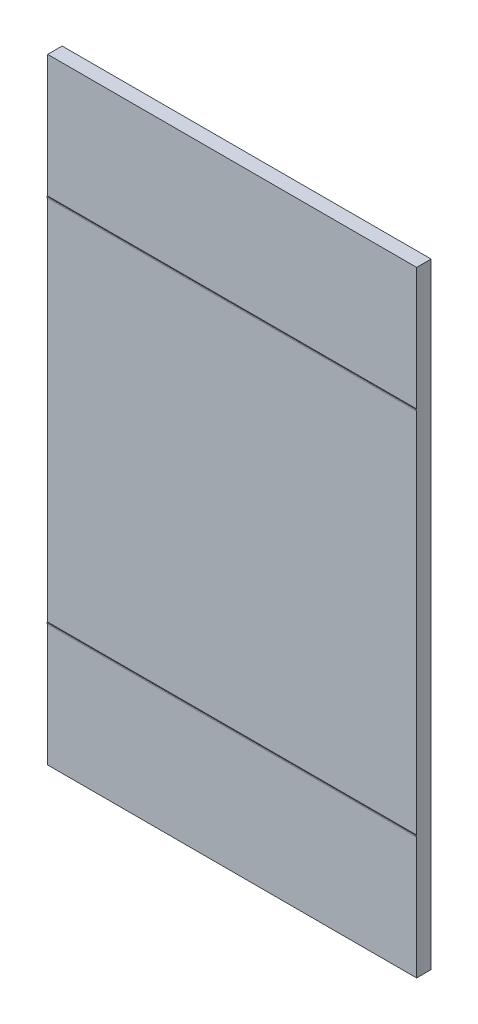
ISO-10303-21;
HEADER;
FILE_DESCRIPTION(('STEP AP214'),'2;1');
FILE_NAME('part.step','',(''),(''),'','','');
FILE_SCHEMA(('AUTOMOTIVE_DESIGN { 1 0 10303 214 1 1 1 1 }'));
ENDSEC;
DATA;
#1=APPLICATION_CONTEXT('core data for automotive mechanical design processes');
#2=APPLICATION_PROTOCOL_DEFINITION('international standard','automotive_design',2000,#1);
#3=PRODUCT_CONTEXT('',#1,'mechanical');
#4=PRODUCT('Part','Part','',(#3));
#5=PRODUCT_RELATED_PRODUCT_CATEGORY('part','',(#4));
#6=PRODUCT_DEFINITION_FORMATION('','',#4);
#7=PRODUCT_DEFINITION_CONTEXT('part definition',#1,'design');
#8=PRODUCT_DEFINITION('design','',#6,#7);
#9=PRODUCT_DEFINITION_SHAPE('','',#8);
#10=(LENGTH_UNIT() NAMED_UNIT(*) SI_UNIT(.MILLI.,.METRE.));
#11=(NAMED_UNIT(*) PLANE_ANGLE_UNIT() SI_UNIT($,.RADIAN.));
#12=(NAMED_UNIT(*) SI_UNIT($,.STERADIAN.) SOLID_ANGLE_UNIT());
#13=UNCERTAINTY_MEASURE_WITH_UNIT(LENGTH_MEASURE(1.E-05),#10,'distance_accuracy_value','');
#14=(GEOMETRIC_REPRESENTATION_CONTEXT(3) GLOBAL_UNCERTAINTY_ASSIGNED_CONTEXT((#13)) GLOBAL_UNIT_ASSIGNED_CONTEXT((#10,
#11,#12)) REPRESENTATION_CONTEXT('',''));
#15=CARTESIAN_POINT('',(0.,0.,0.));
#16=DIRECTION('',(0.,0.,1.));
#17=DIRECTION('',(1.,0.,0.));
#18=AXIS2_PLACEMENT_3D('',#15,#16,#17);
#19=CARTESIAN_POINT('',(0.,0.,29.972));
#20=DIRECTION('',(0.,0.,-1.));
#21=DIRECTION('',(-1.,0.,0.));
#22=AXIS2_PLACEMENT_3D('',#19,#20,#21);
#23=PLANE('',#22);
#24=DIRECTION('',(-1.,0.,0.));
#25=VECTOR('',#24,1.);
#26=CARTESIAN_POINT('',(382.27,-381.,29.972));
#27=LINE('',#26,#25);
#28=CARTESIAN_POINT('',(382.27,-381.,29.972));
#29=VERTEX_POINT('',#28);
#30=CARTESIAN_POINT('',(-382.27,-381.,29.972));
#31=VERTEX_POINT('',#30);
#32=EDGE_CURVE('E139',#29,#31,#27,.T.);
#33=ORIENTED_EDGE('',*,*,#32,.F.);
#34=DIRECTION('',(0.,1.,0.));
#35=VECTOR('',#34,1.);
#36=CARTESIAN_POINT('',(382.27,-637.54,29.972));
#37=LINE('',#36,#35);
#38=CARTESIAN_POINT('',(382.27,381.,29.972));
#39=VERTEX_POINT('',#38);
#40=EDGE_CURVE('E74',#29,#39,#37,.T.);
#41=ORIENTED_EDGE('',*,*,#40,.T.);
#42=DIRECTION('',(-1.,0.,0.));
#43=VECTOR('',#42,1.);
#44=CARTESIAN_POINT('',(382.27,381.,29.972));
#45=LINE('',#44,#43);
#46=CARTESIAN_POINT('',(-382.27,381.,29.972));
#47=VERTEX_POINT('',#46);
#48=EDGE_CURVE('E142',#39,#47,#45,.T.);
#49=ORIENTED_EDGE('',*,*,#48,.T.);
#50=DIRECTION('',(0.,-1.,0.));
#51=VECTOR('',#50,1.);
#52=CARTESIAN_POINT('',(-382.27,-637.54,29.972));
#53=LINE('',#52,#51);
#54=EDGE_CURVE('E138',#47,#31,#53,.T.);
#55=ORIENTED_EDGE('',*,*,#54,.T.);
#56=EDGE_LOOP('',(#33,#41,#49,#55));
#57=FACE_BOUND('',#56,.T.);
#58=ADVANCED_FACE('F51',(#57),#23,.F.);
#59=DIRECTION('',(-1.,0.,0.));
#60=VECTOR('',#59,1.);
#61=CARTESIAN_POINT('',(382.27,383.54,29.972));
#62=LINE('',#61,#60);
#63=CARTESIAN_POINT('',(382.27,383.54,29.972));
#64=VERTEX_POINT('',#63);
#65=CARTESIAN_POINT('',(-382.27,383.54,29.972));
#66=VERTEX_POINT('',#65);
#67=EDGE_CURVE('E66',#64,#66,#62,.T.);
#68=ORIENTED_EDGE('',*,*,#67,.F.);
#69=CARTESIAN_POINT('',(382.27,637.54,29.972));
#70=VERTEX_POINT('',#69);
#71=EDGE_CURVE('E208',#64,#70,#37,.T.);
#72=ORIENTED_EDGE('',*,*,#71,.T.);
#73=DIRECTION('',(-1.,0.,0.));
#74=VECTOR('',#73,1.);
#75=CARTESIAN_POINT('',(382.27,637.54,29.972));
#76=LINE('',#75,#74);
#77=CARTESIAN_POINT('',(-382.27,637.54,29.972));
#78=VERTEX_POINT('',#77);
#79=EDGE_CURVE('E205',#70,#78,#76,.T.);
#80=ORIENTED_EDGE('',*,*,#79,.T.);
#81=EDGE_CURVE('E150',#78,#66,#53,.T.);
#82=ORIENTED_EDGE('',*,*,#81,.T.);
#83=EDGE_LOOP('',(#68,#72,#80,#82));
#84=FACE_BOUND('',#83,.T.);
#85=ADVANCED_FACE('F245',(#84),#23,.F.);
#86=CARTESIAN_POINT('',(382.27,637.54,29.972));
#87=DIRECTION('',(0.,-1.,0.));
#88=DIRECTION('',(0.,0.,-1.));
#89=AXIS2_PLACEMENT_3D('',#86,#87,#88);
#90=PLANE('',#89);
#91=DIRECTION('',(-1.,0.,0.));
#92=VECTOR('',#91,1.);
#93=CARTESIAN_POINT('',(382.27,637.54,0.));
#94=LINE('',#93,#92);
#95=CARTESIAN_POINT('',(382.27,637.54,0.));
#96=VERTEX_POINT('',#95);
#97=CARTESIAN_POINT('',(-382.27,637.54,0.));
#98=VERTEX_POINT('',#97);
#99=EDGE_CURVE('E185',#96,#98,#94,.T.);
#100=ORIENTED_EDGE('',*,*,#99,.T.);
#101=DIRECTION('',(0.,0.,-1.));
#102=VECTOR('',#101,1.);
#103=CARTESIAN_POINT('',(-382.27,637.54,29.972));
#104=LINE('',#103,#102);
#105=EDGE_CURVE('E11',#78,#98,#104,.T.);
#106=ORIENTED_EDGE('',*,*,#105,.F.);
#107=ORIENTED_EDGE('',*,*,#79,.F.);
#108=DIRECTION('',(0.,0.,-1.));
#109=VECTOR('',#108,1.);
#110=CARTESIAN_POINT('',(382.27,637.54,29.972));
#111=LINE('',#110,#109);
#112=EDGE_CURVE('E211',#70,#96,#111,.T.);
#113=ORIENTED_EDGE('',*,*,#112,.T.);
#114=EDGE_LOOP('',(#100,#106,#107,#113));
#115=FACE_BOUND('',#114,.T.);
#116=ADVANCED_FACE('F52',(#115),#90,.F.);
#117=CARTESIAN_POINT('',(-382.27,-637.54,29.972));
#118=DIRECTION('',(1.,0.,0.));
#119=DIRECTION('',(0.,0.,-1.));
#120=AXIS2_PLACEMENT_3D('',#117,#118,#119);
#121=PLANE('',#120);
#122=DIRECTION('',(0.,-1.,0.));
#123=VECTOR('',#122,1.);
#124=CARTESIAN_POINT('',(-382.27,-637.54,0.));
#125=LINE('',#124,#123);
#126=CARTESIAN_POINT('',(-382.27,-637.54,0.));
#127=VERTEX_POINT('',#126);
#128=EDGE_CURVE('E212',#98,#127,#125,.T.);
#129=ORIENTED_EDGE('',*,*,#128,.T.);
#130=DIRECTION('',(0.,0.,-1.));
#131=VECTOR('',#130,1.);
#132=CARTESIAN_POINT('',(-382.27,-637.54,29.972));
#133=LINE('',#132,#131);
#134=CARTESIAN_POINT('',(-382.27,-637.54,29.972));
#135=VERTEX_POINT('',#134);
#136=EDGE_CURVE('E56',#135,#127,#133,.T.);
#137=ORIENTED_EDGE('',*,*,#136,.F.);
#138=CARTESIAN_POINT('',(-382.27,-383.54,29.972));
#139=VERTEX_POINT('',#138);
#140=EDGE_CURVE('E146',#139,#135,#53,.T.);
#141=ORIENTED_EDGE('',*,*,#140,.F.);
#142=DIRECTION('',(0.,0.,-1.));
#143=VECTOR('',#142,1.);
#144=CARTESIAN_POINT('',(-382.27,-383.54,29.972));
#145=LINE('',#144,#143);
#146=CARTESIAN_POINT('',(-382.27,-383.54,31.5595));
#147=VERTEX_POINT('',#146);
#148=EDGE_CURVE('E164',#147,#139,#145,.T.);
#149=ORIENTED_EDGE('',*,*,#148,.F.);
#150=DIRECTION('',(0.,-1.,0.));
#151=VECTOR('',#150,1.);
#152=CARTESIAN_POINT('',(-382.27,-383.54,31.5595));
#153=LINE('',#152,#151);
#154=CARTESIAN_POINT('',(-382.27,-381.,31.5595));
#155=VERTEX_POINT('',#154);
#156=EDGE_CURVE('E163',#155,#147,#153,.T.);
#157=ORIENTED_EDGE('',*,*,#156,.F.);
#158=DIRECTION('',(0.,0.,1.));
#159=VECTOR('',#158,1.);
#160=CARTESIAN_POINT('',(-382.27,-381.,29.972));
#161=LINE('',#160,#159);
#162=EDGE_CURVE('E154',#31,#155,#161,.T.);
#163=ORIENTED_EDGE('',*,*,#162,.F.);
#164=ORIENTED_EDGE('',*,*,#54,.F.);
#165=DIRECTION('',(0.,0.,-1.));
#166=VECTOR('',#165,1.);
#167=CARTESIAN_POINT('',(-382.27,381.,29.972));
#168=LINE('',#167,#166);
#169=CARTESIAN_POINT('',(-382.27,381.,31.5595));
#170=VERTEX_POINT('',#169);
#171=EDGE_CURVE('E194',#170,#47,#168,.T.);
#172=ORIENTED_EDGE('',*,*,#171,.F.);
#173=DIRECTION('',(0.,-1.,0.));
#174=VECTOR('',#173,1.);
#175=CARTESIAN_POINT('',(-382.27,383.54,31.5595));
#176=LINE('',#175,#174);
#177=CARTESIAN_POINT('',(-382.27,383.54,31.5595));
#178=VERTEX_POINT('',#177);
#179=EDGE_CURVE('E197',#178,#170,#176,.T.);
#180=ORIENTED_EDGE('',*,*,#179,.F.);
#181=DIRECTION('',(0.,0.,1.));
#182=VECTOR('',#181,1.);
#183=CARTESIAN_POINT('',(-382.27,383.54,29.972));
#184=LINE('',#183,#182);
#185=EDGE_CURVE('E168',#66,#178,#184,.T.);
#186=ORIENTED_EDGE('',*,*,#185,.F.);
#187=ORIENTED_EDGE('',*,*,#81,.F.);
#188=ORIENTED_EDGE('',*,*,#105,.T.);
#189=EDGE_LOOP('',(#129,#137,#141,#149,#157,#163,#164,#172,#180,#186,#187,#188));
#190=FACE_BOUND('',#189,.T.);
#191=ADVANCED_FACE('F161',(#190),#121,.F.);
#192=CARTESIAN_POINT('',(382.27,-637.54,29.972));
#193=DIRECTION('',(0.,1.,0.));
#194=DIRECTION('',(0.,0.,1.));
#195=AXIS2_PLACEMENT_3D('',#192,#193,#194);
#196=PLANE('',#195);
#197=DIRECTION('',(1.,0.,0.));
#198=VECTOR('',#197,1.);
#199=CARTESIAN_POINT('',(382.27,-637.54,0.));
#200=LINE('',#199,#198);
#201=CARTESIAN_POINT('',(382.27,-637.54,0.));
#202=VERTEX_POINT('',#201);
#203=EDGE_CURVE('E216',#127,#202,#200,.T.);
#204=ORIENTED_EDGE('',*,*,#203,.T.);
#205=DIRECTION('',(0.,0.,-1.));
#206=VECTOR('',#205,1.);
#207=CARTESIAN_POINT('',(382.27,-637.54,29.972));
#208=LINE('',#207,#206);
#209=CARTESIAN_POINT('',(382.27,-637.54,29.972));
#210=VERTEX_POINT('',#209);
#211=EDGE_CURVE('E222',#210,#202,#208,.T.);
#212=ORIENTED_EDGE('',*,*,#211,.F.);
#213=DIRECTION('',(1.,0.,0.));
#214=VECTOR('',#213,1.);
#215=CARTESIAN_POINT('',(382.27,-637.54,29.972));
#216=LINE('',#215,#214);
#217=EDGE_CURVE('E206',#135,#210,#216,.T.);
#218=ORIENTED_EDGE('',*,*,#217,.F.);
#219=ORIENTED_EDGE('',*,*,#136,.T.);
#220=EDGE_LOOP('',(#204,#212,#218,#219));
#221=FACE_BOUND('',#220,.T.);
#222=ADVANCED_FACE('F229',(#221),#196,.F.);
#223=CARTESIAN_POINT('',(382.27,-637.54,29.972));
#224=DIRECTION('',(-1.,0.,0.));
#225=DIRECTION('',(0.,0.,1.));
#226=AXIS2_PLACEMENT_3D('',#223,#224,#225);
#227=PLANE('',#226);
#228=DIRECTION('',(0.,1.,0.));
#229=VECTOR('',#228,1.);
#230=CARTESIAN_POINT('',(382.27,-637.54,0.));
#231=LINE('',#230,#229);
#232=EDGE_CURVE('E204',#202,#96,#231,.T.);
#233=ORIENTED_EDGE('',*,*,#232,.T.);
#234=ORIENTED_EDGE('',*,*,#112,.F.);
#235=ORIENTED_EDGE('',*,*,#71,.F.);
#236=DIRECTION('',(0.,0.,1.));
#237=VECTOR('',#236,1.);
#238=CARTESIAN_POINT('',(382.27,383.54,29.972));
#239=LINE('',#238,#237);
#240=CARTESIAN_POINT('',(382.27,383.54,31.5595));
#241=VERTEX_POINT('',#240);
#242=EDGE_CURVE('E193',#64,#241,#239,.T.);
#243=ORIENTED_EDGE('',*,*,#242,.T.);
#244=DIRECTION('',(0.,-1.,0.));
#245=VECTOR('',#244,1.);
#246=CARTESIAN_POINT('',(382.27,383.54,31.5595));
#247=LINE('',#246,#245);
#248=CARTESIAN_POINT('',(382.27,381.,31.5595));
#249=VERTEX_POINT('',#248);
#250=EDGE_CURVE('E191',#241,#249,#247,.T.);
#251=ORIENTED_EDGE('',*,*,#250,.T.);
#252=DIRECTION('',(0.,0.,-1.));
#253=VECTOR('',#252,1.);
#254=CARTESIAN_POINT('',(382.27,381.,29.972));
#255=LINE('',#254,#253);
#256=EDGE_CURVE('E186',#249,#39,#255,.T.);
#257=ORIENTED_EDGE('',*,*,#256,.T.);
#258=ORIENTED_EDGE('',*,*,#40,.F.);
#259=DIRECTION('',(0.,0.,1.));
#260=VECTOR('',#259,1.);
#261=CARTESIAN_POINT('',(382.27,-381.,29.972));
#262=LINE('',#261,#260);
#263=CARTESIAN_POINT('',(382.27,-381.,31.5595));
#264=VERTEX_POINT('',#263);
#265=EDGE_CURVE('E160',#29,#264,#262,.T.);
#266=ORIENTED_EDGE('',*,*,#265,.T.);
#267=DIRECTION('',(0.,-1.,0.));
#268=VECTOR('',#267,1.);
#269=CARTESIAN_POINT('',(382.27,-383.54,31.5595));
#270=LINE('',#269,#268);
#271=CARTESIAN_POINT('',(382.27,-383.54,31.5595));
#272=VERTEX_POINT('',#271);
#273=EDGE_CURVE('E176',#264,#272,#270,.T.);
#274=ORIENTED_EDGE('',*,*,#273,.T.);
#275=DIRECTION('',(0.,0.,-1.));
#276=VECTOR('',#275,1.);
#277=CARTESIAN_POINT('',(382.27,-383.54,29.972));
#278=LINE('',#277,#276);
#279=CARTESIAN_POINT('',(382.27,-383.54,29.972));
#280=VERTEX_POINT('',#279);
#281=EDGE_CURVE('E170',#272,#280,#278,.T.);
#282=ORIENTED_EDGE('',*,*,#281,.T.);
#283=EDGE_CURVE('E207',#210,#280,#37,.T.);
#284=ORIENTED_EDGE('',*,*,#283,.F.);
#285=ORIENTED_EDGE('',*,*,#211,.T.);
#286=EDGE_LOOP('',(#233,#234,#235,#243,#251,#257,#258,#266,#274,#282,#284,#285));
#287=FACE_BOUND('',#286,.T.);
#288=ADVANCED_FACE('F240',(#287),#227,.F.);
#289=ORIENTED_EDGE('',*,*,#283,.T.);
#290=DIRECTION('',(-1.,0.,0.));
#291=VECTOR('',#290,1.);
#292=CARTESIAN_POINT('',(382.27,-383.54,29.972));
#293=LINE('',#292,#291);
#294=EDGE_CURVE('E158',#280,#139,#293,.T.);
#295=ORIENTED_EDGE('',*,*,#294,.T.);
#296=ORIENTED_EDGE('',*,*,#140,.T.);
#297=ORIENTED_EDGE('',*,*,#217,.T.);
#298=EDGE_LOOP('',(#289,#295,#296,#297));
#299=FACE_BOUND('',#298,.T.);
#300=ADVANCED_FACE('F268',(#299),#23,.F.);
#301=CARTESIAN_POINT('',(0.,0.,0.));
#302=DIRECTION('',(0.,0.,-1.));
#303=DIRECTION('',(-1.,0.,0.));
#304=AXIS2_PLACEMENT_3D('',#301,#302,#303);
#305=PLANE('',#304);
#306=ORIENTED_EDGE('',*,*,#99,.F.);
#307=ORIENTED_EDGE('',*,*,#232,.F.);
#308=ORIENTED_EDGE('',*,*,#203,.F.);
#309=ORIENTED_EDGE('',*,*,#128,.F.);
#310=EDGE_LOOP('',(#306,#307,#308,#309));
#311=FACE_BOUND('',#310,.T.);
#312=ADVANCED_FACE('F232',(#311),#305,.T.);
#313=CARTESIAN_POINT('',(382.27,383.54,29.972));
#314=DIRECTION('',(0.,-1.,0.));
#315=DIRECTION('',(0.,0.,-1.));
#316=AXIS2_PLACEMENT_3D('',#313,#314,#315);
#317=PLANE('',#316);
#318=ORIENTED_EDGE('',*,*,#67,.T.);
#319=ORIENTED_EDGE('',*,*,#185,.T.);
#320=DIRECTION('',(-1.,0.,0.));
#321=VECTOR('',#320,1.);
#322=CARTESIAN_POINT('',(382.27,383.54,31.5595));
#323=LINE('',#322,#321);
#324=EDGE_CURVE('E184',#241,#178,#323,.T.);
#325=ORIENTED_EDGE('',*,*,#324,.F.);
#326=ORIENTED_EDGE('',*,*,#242,.F.);
#327=EDGE_LOOP('',(#318,#319,#325,#326));
#328=FACE_BOUND('',#327,.T.);
#329=ADVANCED_FACE('F246',(#328),#317,.F.);
#330=CARTESIAN_POINT('',(382.27,383.54,31.5595));
#331=DIRECTION('',(0.,0.,-1.));
#332=DIRECTION('',(0.,1.,0.));
#333=AXIS2_PLACEMENT_3D('',#330,#331,#332);
#334=PLANE('',#333);
#335=ORIENTED_EDGE('',*,*,#324,.T.);
#336=ORIENTED_EDGE('',*,*,#179,.T.);
#337=DIRECTION('',(-1.,0.,0.));
#338=VECTOR('',#337,1.);
#339=CARTESIAN_POINT('',(382.27,381.,31.5595));
#340=LINE('',#339,#338);
#341=EDGE_CURVE('E187',#249,#170,#340,.T.);
#342=ORIENTED_EDGE('',*,*,#341,.F.);
#343=ORIENTED_EDGE('',*,*,#250,.F.);
#344=EDGE_LOOP('',(#335,#336,#342,#343));
#345=FACE_BOUND('',#344,.T.);
#346=ADVANCED_FACE('F252',(#345),#334,.F.);
#347=CARTESIAN_POINT('',(382.27,381.,29.972));
#348=DIRECTION('',(0.,1.,0.));
#349=DIRECTION('',(0.,0.,1.));
#350=AXIS2_PLACEMENT_3D('',#347,#348,#349);
#351=PLANE('',#350);
#352=ORIENTED_EDGE('',*,*,#341,.T.);
#353=ORIENTED_EDGE('',*,*,#171,.T.);
#354=ORIENTED_EDGE('',*,*,#48,.F.);
#355=ORIENTED_EDGE('',*,*,#256,.F.);
#356=EDGE_LOOP('',(#352,#353,#354,#355));
#357=FACE_BOUND('',#356,.T.);
#358=ADVANCED_FACE('F254',(#357),#351,.F.);
#359=CARTESIAN_POINT('',(382.27,-383.54,29.972));
#360=DIRECTION('',(0.,1.,0.));
#361=DIRECTION('',(0.,0.,1.));
#362=AXIS2_PLACEMENT_3D('',#359,#360,#361);
#363=PLANE('',#362);
#364=DIRECTION('',(-1.,0.,0.));
#365=VECTOR('',#364,1.);
#366=CARTESIAN_POINT('',(382.27,-383.54,31.5595));
#367=LINE('',#366,#365);
#368=EDGE_CURVE('E178',#272,#147,#367,.T.);
#369=ORIENTED_EDGE('',*,*,#368,.T.);
#370=ORIENTED_EDGE('',*,*,#148,.T.);
#371=ORIENTED_EDGE('',*,*,#294,.F.);
#372=ORIENTED_EDGE('',*,*,#281,.F.);
#373=EDGE_LOOP('',(#369,#370,#371,#372));
#374=FACE_BOUND('',#373,.T.);
#375=ADVANCED_FACE('F260',(#374),#363,.F.);
#376=CARTESIAN_POINT('',(382.27,-381.,29.972));
#377=DIRECTION('',(0.,-1.,0.));
#378=DIRECTION('',(0.,0.,-1.));
#379=AXIS2_PLACEMENT_3D('',#376,#377,#378);
#380=PLANE('',#379);
#381=ORIENTED_EDGE('',*,*,#32,.T.);
#382=ORIENTED_EDGE('',*,*,#162,.T.);
#383=DIRECTION('',(-1.,0.,0.));
#384=VECTOR('',#383,1.);
#385=CARTESIAN_POINT('',(382.27,-381.,31.5595));
#386=LINE('',#385,#384);
#387=EDGE_CURVE('E157',#264,#155,#386,.T.);
#388=ORIENTED_EDGE('',*,*,#387,.F.);
#389=ORIENTED_EDGE('',*,*,#265,.F.);
#390=EDGE_LOOP('',(#381,#382,#388,#389));
#391=FACE_BOUND('',#390,.T.);
#392=ADVANCED_FACE('F153',(#391),#380,.F.);
#393=CARTESIAN_POINT('',(382.27,-383.54,31.5595));
#394=DIRECTION('',(0.,0.,-1.));
#395=DIRECTION('',(0.,1.,0.));
#396=AXIS2_PLACEMENT_3D('',#393,#394,#395);
#397=PLANE('',#396);
#398=ORIENTED_EDGE('',*,*,#387,.T.);
#399=ORIENTED_EDGE('',*,*,#156,.T.);
#400=ORIENTED_EDGE('',*,*,#368,.F.);
#401=ORIENTED_EDGE('',*,*,#273,.F.);
#402=EDGE_LOOP('',(#398,#399,#400,#401));
#403=FACE_BOUND('',#402,.T.);
#404=ADVANCED_FACE('F283',(#403),#397,.F.);
#405=CLOSED_SHELL('',(#58,#85,#116,#191,#222,#288,#300,#312,#329,#346,#358,#375,#392,#404));
#406=MANIFOLD_SOLID_BREP('B2',#405);
#407=ADVANCED_BREP_SHAPE_REPRESENTATION('',(#18,#406),#14);
#408=SHAPE_DEFINITION_REPRESENTATION(#9,#407);
ENDSEC;
END-ISO-10303-21;
